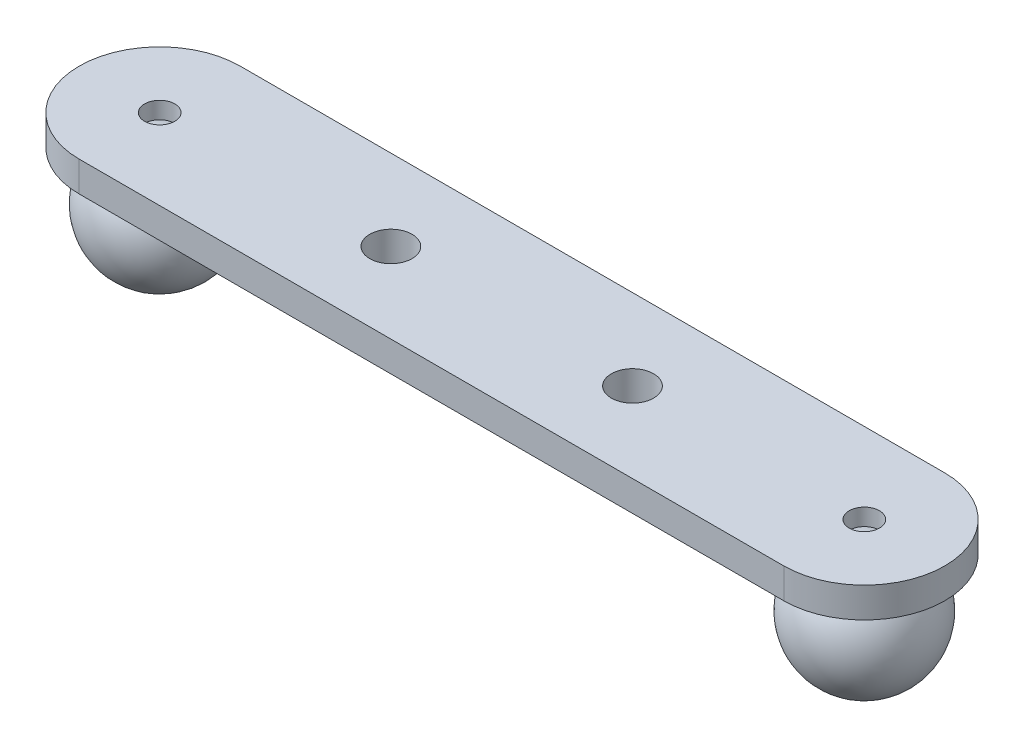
ISO-10303-21;
HEADER;
FILE_DESCRIPTION(('STEP AP214'),'2;1');
FILE_NAME('part.step','',(''),(''),'','','');
FILE_SCHEMA(('AUTOMOTIVE_DESIGN { 1 0 10303 214 1 1 1 1 }'));
ENDSEC;
DATA;
#1=APPLICATION_CONTEXT('core data for automotive mechanical design processes');
#2=APPLICATION_PROTOCOL_DEFINITION('international standard','automotive_design',2000,#1);
#3=PRODUCT_CONTEXT('',#1,'mechanical');
#4=PRODUCT('Part','Part','',(#3));
#5=PRODUCT_RELATED_PRODUCT_CATEGORY('part','',(#4));
#6=PRODUCT_DEFINITION_FORMATION('','',#4);
#7=PRODUCT_DEFINITION_CONTEXT('part definition',#1,'design');
#8=PRODUCT_DEFINITION('design','',#6,#7);
#9=PRODUCT_DEFINITION_SHAPE('','',#8);
#10=(LENGTH_UNIT() NAMED_UNIT(*) SI_UNIT(.MILLI.,.METRE.));
#11=(NAMED_UNIT(*) PLANE_ANGLE_UNIT() SI_UNIT($,.RADIAN.));
#12=(NAMED_UNIT(*) SI_UNIT($,.STERADIAN.) SOLID_ANGLE_UNIT());
#13=UNCERTAINTY_MEASURE_WITH_UNIT(LENGTH_MEASURE(1.E-05),#10,'distance_accuracy_value','');
#14=(GEOMETRIC_REPRESENTATION_CONTEXT(3) GLOBAL_UNCERTAINTY_ASSIGNED_CONTEXT((#13)) GLOBAL_UNIT_ASSIGNED_CONTEXT((#10,
#11,#12)) REPRESENTATION_CONTEXT('',''));
#15=CARTESIAN_POINT('',(0.,0.,0.));
#16=DIRECTION('',(0.,0.,1.));
#17=DIRECTION('',(1.,0.,0.));
#18=AXIS2_PLACEMENT_3D('',#15,#16,#17);
#19=CARTESIAN_POINT('',(-17.442816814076,167.481314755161,357.346395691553));
#20=DIRECTION('',(0.,0.,1.));
#21=DIRECTION('',(0.500000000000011,0.866025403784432,0.));
#22=AXIS2_PLACEMENT_3D('',#19,#20,#21);
#23=SPHERICAL_SURFACE('',#22,6.34999999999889);
#24=CARTESIAN_POINT('',(-17.442816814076,167.481314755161,363.696395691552));
#25=VERTEX_POINT('',#24);
#26=VERTEX_LOOP('',#25);
#27=FACE_BOUND('',#26,.T.);
#28=ADVANCED_FACE('P0_F12',(#27),#23,.T.);
#29=CLOSED_SHELL('',(#28));
#30=MANIFOLD_SOLID_BREP('P0_B1',#29);
#31=CARTESIAN_POINT('',(-36.1928168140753,172.331324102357,347.34639569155));
#32=DIRECTION('',(0.,-1.,0.));
#33=DIRECTION('',(0.,0.,-1.));
#34=AXIS2_PLACEMENT_3D('',#31,#32,#33);
#35=PLANE('',#34);
#36=CARTESIAN_POINT('',(52.557183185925,172.331324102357,357.346395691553));
#37=DIRECTION('',(0.,-1.,0.));
#38=DIRECTION('',(0.,0.,-1.));
#39=AXIS2_PLACEMENT_3D('',#36,#37,#38);
#40=CIRCLE('',#39,4.09876924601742);
#41=CARTESIAN_POINT('',(52.557183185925,172.331324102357,353.247626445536));
#42=VERTEX_POINT('',#41);
#43=EDGE_CURVE('P1_E20',#42,#42,#40,.T.);
#44=ORIENTED_EDGE('',*,*,#43,.F.);
#45=EDGE_LOOP('',(#44));
#46=FACE_BOUND('',#45,.T.);
#47=CARTESIAN_POINT('',(-17.442816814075,172.331324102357,357.346395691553));
#48=DIRECTION('',(0.,-1.,0.));
#49=DIRECTION('',(0.,0.,-1.));
#50=AXIS2_PLACEMENT_3D('',#47,#48,#49);
#51=CIRCLE('',#50,4.09876924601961);
#52=CARTESIAN_POINT('',(-17.442816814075,172.331324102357,353.247626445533));
#53=VERTEX_POINT('',#52);
#54=EDGE_CURVE('P1_E82',#53,#53,#51,.T.);
#55=ORIENTED_EDGE('',*,*,#54,.F.);
#56=EDGE_LOOP('',(#55));
#57=FACE_BOUND('',#56,.T.);
#58=CARTESIAN_POINT('',(5.55718318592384,172.331324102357,357.377815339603));
#59=DIRECTION('',(0.,-1.,0.));
#60=DIRECTION('',(0.,0.,-1.));
#61=AXIS2_PLACEMENT_3D('',#58,#59,#60);
#62=CIRCLE('',#61,2.10000000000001);
#63=CARTESIAN_POINT('',(5.55718318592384,172.331324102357,355.277815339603));
#64=VERTEX_POINT('',#63);
#65=EDGE_CURVE('P1_E104',#64,#64,#62,.T.);
#66=ORIENTED_EDGE('',*,*,#65,.F.);
#67=EDGE_LOOP('',(#66));
#68=FACE_BOUND('',#67,.T.);
#69=CARTESIAN_POINT('',(29.557183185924,172.331324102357,357.377815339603));
#70=DIRECTION('',(0.,-1.,0.));
#71=DIRECTION('',(0.,0.,-1.));
#72=AXIS2_PLACEMENT_3D('',#69,#70,#71);
#73=CIRCLE('',#72,2.10000000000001);
#74=CARTESIAN_POINT('',(29.557183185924,172.331324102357,355.277815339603));
#75=VERTEX_POINT('',#74);
#76=EDGE_CURVE('P1_E107',#75,#75,#73,.T.);
#77=ORIENTED_EDGE('',*,*,#76,.F.);
#78=EDGE_LOOP('',(#77));
#79=FACE_BOUND('',#78,.T.);
#80=CARTESIAN_POINT('',(-17.4428168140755,172.331324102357,357.34639569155));
#81=DIRECTION('',(0.,-1.,0.));
#82=DIRECTION('',(0.,0.,-1.));
#83=AXIS2_PLACEMENT_3D('',#80,#81,#82);
#84=CIRCLE('',#83,7.99999999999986);
#85=CARTESIAN_POINT('',(-17.4428168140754,172.331324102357,349.34639569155));
#86=VERTEX_POINT('',#85);
#87=CARTESIAN_POINT('',(-17.4428168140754,172.331324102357,365.34639569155));
#88=VERTEX_POINT('',#87);
#89=EDGE_CURVE('P1_E59',#86,#88,#84,.F.);
#90=ORIENTED_EDGE('',*,*,#89,.F.);
#91=DIRECTION('',(-1.,0.,0.));
#92=VECTOR('',#91,1.);
#93=CARTESIAN_POINT('',(17.5571831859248,172.331324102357,349.34639569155));
#94=LINE('',#93,#92);
#95=CARTESIAN_POINT('',(52.5571831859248,172.331324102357,349.34639569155));
#96=VERTEX_POINT('',#95);
#97=EDGE_CURVE('P1_E54',#96,#86,#94,.T.);
#98=ORIENTED_EDGE('',*,*,#97,.F.);
#99=CARTESIAN_POINT('',(52.5571831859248,172.331324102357,357.34639569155));
#100=DIRECTION('',(0.,-1.,0.));
#101=DIRECTION('',(1.,0.,0.));
#102=AXIS2_PLACEMENT_3D('',#99,#100,#101);
#103=CIRCLE('',#102,7.99999999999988);
#104=CARTESIAN_POINT('',(52.5571831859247,172.331324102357,365.34639569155));
#105=VERTEX_POINT('',#104);
#106=EDGE_CURVE('P1_E71',#105,#96,#103,.F.);
#107=ORIENTED_EDGE('',*,*,#106,.F.);
#108=DIRECTION('',(1.,0.,0.));
#109=VECTOR('',#108,1.);
#110=CARTESIAN_POINT('',(17.5571831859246,172.331324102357,365.34639569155));
#111=LINE('',#110,#109);
#112=EDGE_CURVE('P1_E69',#88,#105,#111,.T.);
#113=ORIENTED_EDGE('',*,*,#112,.F.);
#114=EDGE_LOOP('',(#90,#98,#107,#113));
#115=FACE_BOUND('',#114,.T.);
#116=ADVANCED_FACE('P1_F16',(#46,#57,#68,#79,#115),#35,.T.);
#117=CARTESIAN_POINT('',(52.557183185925,167.481314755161,357.346395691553));
#118=DIRECTION('',(0.,0.,1.));
#119=DIRECTION('',(-0.50000000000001,0.866025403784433,0.));
#120=AXIS2_PLACEMENT_3D('',#117,#118,#119);
#121=SPHERICAL_SURFACE('',#120,6.34999999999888);
#122=CARTESIAN_POINT('',(52.557183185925,167.481314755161,357.346395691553));
#123=DIRECTION('',(0.,-1.,0.));
#124=DIRECTION('',(0.,0.,-1.));
#125=AXIS2_PLACEMENT_3D('',#122,#123,#124);
#126=SPHERICAL_SURFACE('',#125,6.34999999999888);
#127=CARTESIAN_POINT('',(52.5571831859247,173.651606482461,357.34639569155));
#128=DIRECTION('',(0.,-1.,0.));
#129=DIRECTION('',(0.,0.,-1.));
#130=AXIS2_PLACEMENT_3D('',#127,#128,#129);
#131=CIRCLE('',#130,1.50000000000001);
#132=CARTESIAN_POINT('',(52.5571831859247,173.651606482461,355.84639569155));
#133=VERTEX_POINT('',#132);
#134=EDGE_CURVE('P1_E101',#133,#133,#131,.T.);
#135=ORIENTED_EDGE('',*,*,#134,.F.);
#136=EDGE_LOOP('',(#135));
#137=FACE_BOUND('',#136,.T.);
#138=ORIENTED_EDGE('',*,*,#43,.T.);
#139=EDGE_LOOP('',(#138));
#140=FACE_BOUND('',#139,.T.);
#141=ADVANCED_FACE('P1_F117',(#137,#140),#126,.F.);
#142=CARTESIAN_POINT('',(-17.442816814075,167.481314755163,357.346395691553));
#143=DIRECTION('',(0.,0.,1.));
#144=DIRECTION('',(-0.500000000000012,-0.866025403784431,0.));
#145=AXIS2_PLACEMENT_3D('',#142,#143,#144);
#146=SPHERICAL_SURFACE('',#145,6.3499999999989);
#147=CARTESIAN_POINT('',(-17.442816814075,167.481314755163,357.346395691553));
#148=DIRECTION('',(0.,-1.,0.));
#149=DIRECTION('',(0.,0.,-1.));
#150=AXIS2_PLACEMENT_3D('',#147,#148,#149);
#151=SPHERICAL_SURFACE('',#150,6.3499999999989);
#152=CARTESIAN_POINT('',(-17.4428168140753,173.651606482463,357.34639569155));
#153=DIRECTION('',(0.,-1.,0.));
#154=DIRECTION('',(0.,0.,-1.));
#155=AXIS2_PLACEMENT_3D('',#152,#153,#154);
#156=CIRCLE('',#155,1.50000000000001);
#157=CARTESIAN_POINT('',(-17.4428168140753,173.651606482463,355.84639569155));
#158=VERTEX_POINT('',#157);
#159=EDGE_CURVE('P1_E98',#158,#158,#156,.T.);
#160=ORIENTED_EDGE('',*,*,#159,.F.);
#161=EDGE_LOOP('',(#160));
#162=FACE_BOUND('',#161,.T.);
#163=ORIENTED_EDGE('',*,*,#54,.T.);
#164=EDGE_LOOP('',(#163));
#165=FACE_BOUND('',#164,.T.);
#166=ADVANCED_FACE('P1_F147',(#162,#165),#151,.F.);
#167=CARTESIAN_POINT('',(-17.4428168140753,175.331324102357,349.34639569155));
#168=DIRECTION('',(0.,0.,-1.));
#169=DIRECTION('',(1.,0.,0.));
#170=AXIS2_PLACEMENT_3D('',#167,#168,#169);
#171=PLANE('',#170);
#172=ORIENTED_EDGE('',*,*,#97,.T.);
#173=DIRECTION('',(0.,-1.,0.));
#174=VECTOR('',#173,1.);
#175=CARTESIAN_POINT('',(-17.4428168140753,173.831324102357,349.34639569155));
#176=LINE('',#175,#174);
#177=CARTESIAN_POINT('',(-17.4428168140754,175.331324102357,349.34639569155));
#178=VERTEX_POINT('',#177);
#179=EDGE_CURVE('P1_E65',#178,#86,#176,.T.);
#180=ORIENTED_EDGE('',*,*,#179,.F.);
#181=DIRECTION('',(1.,0.,0.));
#182=VECTOR('',#181,1.);
#183=CARTESIAN_POINT('',(-36.1928168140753,175.331324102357,349.34639569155));
#184=LINE('',#183,#182);
#185=CARTESIAN_POINT('',(52.5571831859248,175.331324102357,349.34639569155));
#186=VERTEX_POINT('',#185);
#187=EDGE_CURVE('P1_E97',#186,#178,#184,.F.);
#188=ORIENTED_EDGE('',*,*,#187,.F.);
#189=DIRECTION('',(0.,1.,0.));
#190=VECTOR('',#189,1.);
#191=CARTESIAN_POINT('',(52.5571831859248,173.831324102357,349.34639569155));
#192=LINE('',#191,#190);
#193=EDGE_CURVE('P1_E110',#96,#186,#192,.T.);
#194=ORIENTED_EDGE('',*,*,#193,.F.);
#195=EDGE_LOOP('',(#172,#180,#188,#194));
#196=FACE_BOUND('',#195,.T.);
#197=ADVANCED_FACE('P1_F145',(#196),#171,.T.);
#198=CARTESIAN_POINT('',(-17.4428168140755,175.331324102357,357.34639569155));
#199=DIRECTION('',(0.,-1.,0.));
#200=DIRECTION('',(0.,0.,-1.));
#201=AXIS2_PLACEMENT_3D('',#198,#199,#200);
#202=CYLINDRICAL_SURFACE('',#201,7.99999999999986);
#203=ORIENTED_EDGE('',*,*,#89,.T.);
#204=DIRECTION('',(0.,-1.,0.));
#205=VECTOR('',#204,1.);
#206=CARTESIAN_POINT('',(-17.4428168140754,173.831324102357,365.34639569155));
#207=LINE('',#206,#205);
#208=CARTESIAN_POINT('',(-17.4428168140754,175.331324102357,365.34639569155));
#209=VERTEX_POINT('',#208);
#210=EDGE_CURVE('P1_E64',#209,#88,#207,.T.);
#211=ORIENTED_EDGE('',*,*,#210,.F.);
#212=CARTESIAN_POINT('',(-17.4428168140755,175.331324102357,357.34639569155));
#213=DIRECTION('',(0.,-1.,0.));
#214=DIRECTION('',(0.,0.,-1.));
#215=AXIS2_PLACEMENT_3D('',#212,#213,#214);
#216=CIRCLE('',#215,7.99999999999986);
#217=EDGE_CURVE('P1_E95',#178,#209,#216,.F.);
#218=ORIENTED_EDGE('',*,*,#217,.F.);
#219=ORIENTED_EDGE('',*,*,#179,.T.);
#220=EDGE_LOOP('',(#203,#211,#218,#219));
#221=FACE_BOUND('',#220,.T.);
#222=ADVANCED_FACE('P1_F61',(#221),#202,.T.);
#223=CARTESIAN_POINT('',(52.5571831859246,175.331324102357,365.34639569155));
#224=DIRECTION('',(0.,0.,1.));
#225=DIRECTION('',(-1.,0.,0.));
#226=AXIS2_PLACEMENT_3D('',#223,#224,#225);
#227=PLANE('',#226);
#228=ORIENTED_EDGE('',*,*,#112,.T.);
#229=DIRECTION('',(0.,-1.,0.));
#230=VECTOR('',#229,1.);
#231=CARTESIAN_POINT('',(52.5571831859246,173.831324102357,365.34639569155));
#232=LINE('',#231,#230);
#233=CARTESIAN_POINT('',(52.5571831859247,175.331324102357,365.34639569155));
#234=VERTEX_POINT('',#233);
#235=EDGE_CURVE('P1_E35',#234,#105,#232,.T.);
#236=ORIENTED_EDGE('',*,*,#235,.F.);
#237=DIRECTION('',(1.,0.,0.));
#238=VECTOR('',#237,1.);
#239=CARTESIAN_POINT('',(-36.1928168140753,175.331324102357,365.34639569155));
#240=LINE('',#239,#238);
#241=EDGE_CURVE('P1_E75',#209,#234,#240,.T.);
#242=ORIENTED_EDGE('',*,*,#241,.F.);
#243=ORIENTED_EDGE('',*,*,#210,.T.);
#244=EDGE_LOOP('',(#228,#236,#242,#243));
#245=FACE_BOUND('',#244,.T.);
#246=ADVANCED_FACE('P1_F73',(#245),#227,.T.);
#247=CARTESIAN_POINT('',(52.5571831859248,175.331324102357,357.34639569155));
#248=DIRECTION('',(0.,-1.,0.));
#249=DIRECTION('',(1.,0.,0.));
#250=AXIS2_PLACEMENT_3D('',#247,#248,#249);
#251=CYLINDRICAL_SURFACE('',#250,7.99999999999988);
#252=ORIENTED_EDGE('',*,*,#106,.T.);
#253=ORIENTED_EDGE('',*,*,#193,.T.);
#254=CARTESIAN_POINT('',(52.5571831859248,175.331324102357,357.34639569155));
#255=DIRECTION('',(0.,-1.,0.));
#256=DIRECTION('',(1.,0.,0.));
#257=AXIS2_PLACEMENT_3D('',#254,#255,#256);
#258=CIRCLE('',#257,7.99999999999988);
#259=EDGE_CURVE('P1_E92',#234,#186,#258,.F.);
#260=ORIENTED_EDGE('',*,*,#259,.F.);
#261=ORIENTED_EDGE('',*,*,#235,.T.);
#262=EDGE_LOOP('',(#252,#253,#260,#261));
#263=FACE_BOUND('',#262,.T.);
#264=ADVANCED_FACE('P1_F131',(#263),#251,.T.);
#265=CARTESIAN_POINT('',(29.5571831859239,175.331324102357,357.377815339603));
#266=DIRECTION('',(0.,-1.,0.));
#267=DIRECTION('',(0.,0.,-1.));
#268=AXIS2_PLACEMENT_3D('',#265,#266,#267);
#269=CYLINDRICAL_SURFACE('',#268,2.10000000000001);
#270=ORIENTED_EDGE('',*,*,#76,.T.);
#271=EDGE_LOOP('',(#270));
#272=FACE_BOUND('',#271,.T.);
#273=CARTESIAN_POINT('',(29.5571831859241,175.331324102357,357.377815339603));
#274=DIRECTION('',(0.,-1.,0.));
#275=DIRECTION('',(1.,0.,0.));
#276=AXIS2_PLACEMENT_3D('',#273,#274,#275);
#277=CIRCLE('',#276,2.10000000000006);
#278=CARTESIAN_POINT('',(31.6571831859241,175.331324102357,357.377815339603));
#279=VERTEX_POINT('',#278);
#280=EDGE_CURVE('P1_E89',#279,#279,#277,.T.);
#281=ORIENTED_EDGE('',*,*,#280,.F.);
#282=EDGE_LOOP('',(#281));
#283=FACE_BOUND('',#282,.T.);
#284=ADVANCED_FACE('P1_F127',(#272,#283),#269,.F.);
#285=CARTESIAN_POINT('',(5.5571831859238,175.331324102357,357.377815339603));
#286=DIRECTION('',(0.,-1.,0.));
#287=DIRECTION('',(0.,0.,-1.));
#288=AXIS2_PLACEMENT_3D('',#285,#286,#287);
#289=CYLINDRICAL_SURFACE('',#288,2.10000000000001);
#290=ORIENTED_EDGE('',*,*,#65,.T.);
#291=EDGE_LOOP('',(#290));
#292=FACE_BOUND('',#291,.T.);
#293=CARTESIAN_POINT('',(5.55718318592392,175.331324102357,357.377815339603));
#294=DIRECTION('',(0.,-1.,0.));
#295=DIRECTION('',(1.,0.,0.));
#296=AXIS2_PLACEMENT_3D('',#293,#294,#295);
#297=CIRCLE('',#296,2.10000000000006);
#298=CARTESIAN_POINT('',(7.65718318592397,175.331324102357,357.377815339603));
#299=VERTEX_POINT('',#298);
#300=EDGE_CURVE('P1_E86',#299,#299,#297,.T.);
#301=ORIENTED_EDGE('',*,*,#300,.F.);
#302=EDGE_LOOP('',(#301));
#303=FACE_BOUND('',#302,.T.);
#304=ADVANCED_FACE('P1_F130',(#292,#303),#289,.F.);
#305=CARTESIAN_POINT('',(52.5571831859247,175.331324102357,357.34639569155));
#306=DIRECTION('',(0.,-1.,0.));
#307=DIRECTION('',(0.,0.,-1.));
#308=AXIS2_PLACEMENT_3D('',#305,#306,#307);
#309=CYLINDRICAL_SURFACE('',#308,1.50000000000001);
#310=ORIENTED_EDGE('',*,*,#134,.T.);
#311=EDGE_LOOP('',(#310));
#312=FACE_BOUND('',#311,.T.);
#313=CARTESIAN_POINT('',(52.5571831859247,175.331324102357,357.34639569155));
#314=DIRECTION('',(0.,-1.,0.));
#315=DIRECTION('',(0.,0.,-1.));
#316=AXIS2_PLACEMENT_3D('',#313,#314,#315);
#317=CIRCLE('',#316,1.5);
#318=CARTESIAN_POINT('',(52.5571831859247,175.331324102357,355.84639569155));
#319=VERTEX_POINT('',#318);
#320=EDGE_CURVE('P1_E26',#319,#319,#317,.T.);
#321=ORIENTED_EDGE('',*,*,#320,.F.);
#322=EDGE_LOOP('',(#321));
#323=FACE_BOUND('',#322,.T.);
#324=ADVANCED_FACE('P1_F164',(#312,#323),#309,.F.);
#325=CARTESIAN_POINT('',(-17.4428168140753,175.331324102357,357.34639569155));
#326=DIRECTION('',(0.,-1.,0.));
#327=DIRECTION('',(0.,0.,-1.));
#328=AXIS2_PLACEMENT_3D('',#325,#326,#327);
#329=CYLINDRICAL_SURFACE('',#328,1.50000000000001);
#330=ORIENTED_EDGE('',*,*,#159,.T.);
#331=EDGE_LOOP('',(#330));
#332=FACE_BOUND('',#331,.T.);
#333=CARTESIAN_POINT('',(-17.4428168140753,175.331324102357,357.34639569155));
#334=DIRECTION('',(0.,-1.,0.));
#335=DIRECTION('',(0.,0.,-1.));
#336=AXIS2_PLACEMENT_3D('',#333,#334,#335);
#337=CIRCLE('',#336,1.5);
#338=CARTESIAN_POINT('',(-17.4428168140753,175.331324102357,355.84639569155));
#339=VERTEX_POINT('',#338);
#340=EDGE_CURVE('P1_E11',#339,#339,#337,.T.);
#341=ORIENTED_EDGE('',*,*,#340,.F.);
#342=EDGE_LOOP('',(#341));
#343=FACE_BOUND('',#342,.T.);
#344=ADVANCED_FACE('P1_F18',(#332,#343),#329,.F.);
#345=CARTESIAN_POINT('',(-36.1928168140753,175.331324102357,347.34639569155));
#346=DIRECTION('',(0.,1.,0.));
#347=DIRECTION('',(0.,0.,1.));
#348=AXIS2_PLACEMENT_3D('',#345,#346,#347);
#349=PLANE('',#348);
#350=ORIENTED_EDGE('',*,*,#340,.T.);
#351=EDGE_LOOP('',(#350));
#352=FACE_BOUND('',#351,.T.);
#353=ORIENTED_EDGE('',*,*,#320,.T.);
#354=EDGE_LOOP('',(#353));
#355=FACE_BOUND('',#354,.T.);
#356=ORIENTED_EDGE('',*,*,#300,.T.);
#357=EDGE_LOOP('',(#356));
#358=FACE_BOUND('',#357,.T.);
#359=ORIENTED_EDGE('',*,*,#280,.T.);
#360=EDGE_LOOP('',(#359));
#361=FACE_BOUND('',#360,.T.);
#362=ORIENTED_EDGE('',*,*,#241,.T.);
#363=ORIENTED_EDGE('',*,*,#259,.T.);
#364=ORIENTED_EDGE('',*,*,#187,.T.);
#365=ORIENTED_EDGE('',*,*,#217,.T.);
#366=EDGE_LOOP('',(#362,#363,#364,#365));
#367=FACE_BOUND('',#366,.T.);
#368=ADVANCED_FACE('P1_F135',(#352,#355,#358,#361,#367),#349,.T.);
#369=CLOSED_SHELL('',(#116,#141,#166,#197,#222,#246,#264,#284,#304,#324,#344,#368));
#370=MANIFOLD_SOLID_BREP('P1_B1',#369);
#371=CARTESIAN_POINT('',(52.557183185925,167.481314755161,357.346395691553));
#372=DIRECTION('',(0.,0.,1.));
#373=DIRECTION('',(-0.50000000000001,0.866025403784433,0.));
#374=AXIS2_PLACEMENT_3D('',#371,#372,#373);
#375=SPHERICAL_SURFACE('',#374,6.34999999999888);
#376=CARTESIAN_POINT('',(52.557183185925,167.481314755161,363.696395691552));
#377=VERTEX_POINT('',#376);
#378=VERTEX_LOOP('',#377);
#379=FACE_BOUND('',#378,.T.);
#380=ADVANCED_FACE('P2_F12',(#379),#375,.T.);
#381=CLOSED_SHELL('',(#380));
#382=MANIFOLD_SOLID_BREP('P2_B1',#381);
#383=ADVANCED_BREP_SHAPE_REPRESENTATION('',(#18,#30,#370,#382),#14);
#384=SHAPE_DEFINITION_REPRESENTATION(#9,#383);
ENDSEC;
END-ISO-10303-21;
